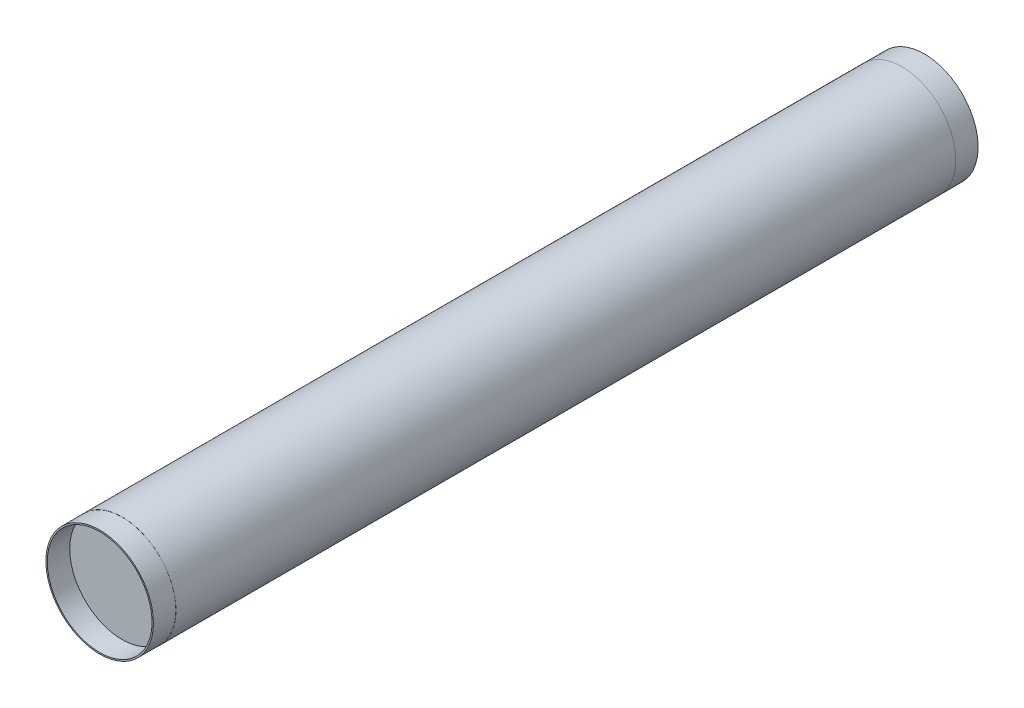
from build123d import *

# Parameters (mm, degrees)
SKETCH1_R               = 76.327
SKETCH1_R_2             = 74.2188
BOSS_EXTRUDE1_DEPTH     = 609.6
CUT_EXTRUDE1_DEPTH      = 620.083016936
CUT_EXTRUDE1_DEPTH_BACK = 620.083016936
SKETCH3_OUTSIDE_W       = 392.29
SKETCH3_OUTSIDE_H       = 392.29
SKETCH3_OUTSIDE_R       = 76.2
CUT_EXTRUDE2_DEPTH      = 31.75
SKETCH4_OUTSIDE_W       = 392.29
SKETCH4_OUTSIDE_H       = 392.29
SKETCH4_OUTSIDE_R       = 76.2
CUT_EXTRUDE3_DEPTH      = 31.75


with BuildPart() as part:
    # Sketch1 → Boss-Extrude1 (new, symmetric)
    with BuildSketch(Plane.XY):
        with Locations(Location((0, 0, 0), (0, 0, 180))):
            Circle(SKETCH1_R)
        with Locations(Location((0, 0, 0), (0, 0, 180))):
            Circle(SKETCH1_R_2, mode=Mode.SUBTRACT)
    extrude(amount=BOSS_EXTRUDE1_DEPTH, both=True)

    # Sketch2 → Cut-Extrude1 (cut, two sides: drawn at the far end of the back side and taken through both)
    with BuildSketch(Plane(origin=(0, 0, 0), x_dir=(0, 0, -1), z_dir=(1, 0, 0)).offset(-CUT_EXTRUDE1_DEPTH_BACK)):
        Polygon((558.8, 2494.630990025), (558.8, 116.289931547), (558.8, -112.033544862), (558.8, -2490.37460334), (5315.482116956, -2490.37460334), (5315.482116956, 2494.630990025), align=None)
    extrude(amount=CUT_EXTRUDE1_DEPTH + CUT_EXTRUDE1_DEPTH_BACK, mode=Mode.SUBTRACT)

    # Sketch3 outside → Cut-Extrude2 (cut)
    with BuildSketch(Plane.XY.offset(609.6)):
        Rectangle(SKETCH3_OUTSIDE_W, SKETCH3_OUTSIDE_H)
        Circle(SKETCH3_OUTSIDE_R, mode=Mode.SUBTRACT)
    extrude(amount=-CUT_EXTRUDE2_DEPTH, mode=Mode.SUBTRACT)

    # Sketch4 outside → Cut-Extrude3 (cut)
    with BuildSketch(Plane(origin=(0, 0, -558.8), x_dir=(-1, 0, 0), z_dir=(0, 0, -1))):
        Rectangle(SKETCH4_OUTSIDE_W, SKETCH4_OUTSIDE_H)
        with Locations(Location((0, 0, 0), (0, 0, 180))):
            Circle(SKETCH4_OUTSIDE_R, mode=Mode.SUBTRACT)
    extrude(amount=-CUT_EXTRUDE3_DEPTH, mode=Mode.SUBTRACT)


solid = part.part
